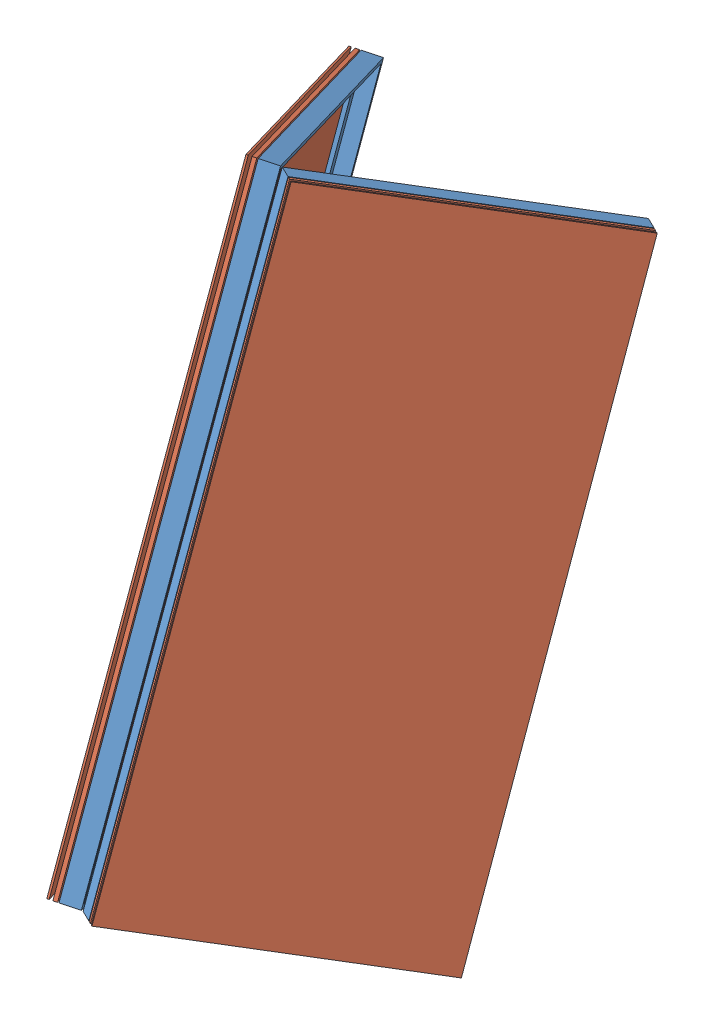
SolidWorks assembly Assem2.SLDASM, configuration Standard (file format 4400). Lengths in mm.
Overall size (12564.82 4473.31 4470.35).
6 component instances, 2 part files, 6 mates.
Components (placement in the parent):
- Assem1-1: Assem1.SLDASM [Standard] at (-79.774 27.3891 45.9497) x (0.459632 0.305774 0.833811) z (-0.834211 -0.173446 0.523459) size (3717.49 4041.67 1471.05)
  - Steelframe-1: Steelframe.SLDPRT [Standard] at origin size (1557 3086.49 1200.83)
  - Glass-1: Glass.sldprt [Default] at origin size (1557 3069.73 1154.79)
- Assem1-2: Assem1.SLDASM [Standard] at (810.2598 506.5604 1351.5585) x (0.538777 -0.288136 -0.791641) z (0.792711 -0.144705 0.592174) size (3717.49 4041.67 1471.05)
  - Steelframe-1: Steelframe.SLDPRT [Standard] at origin size (1557 3086.49 1200.83)
  - Glass-1: Glass.sldprt [Default] at origin size (1557 3069.73 1154.79)
Mates (geometry in assembly coordinates):
- Coincident3: coincident: unknown of ?
- Coincident6: coincident: unknown of ?
- Coincident7: coincident anti-aligned: line of ? through (0 3072.7949 -1118.4059) axis (0 -0.939693 0.34202)
- Coincident11: coincident: point of ?; point of ?
- Coincident13: coincident: point of ?; point of ?
- LimitAngle2: limit planar angle = 2.095021 rad aligned: plane of ? through (-125.9557 35.5637 68.4093) normal (-0.888109 0.157204 0.431914); plane of ? through (854.0668 516.3248 1377.8188) normal (0.842442 0.187776 0.505006)
